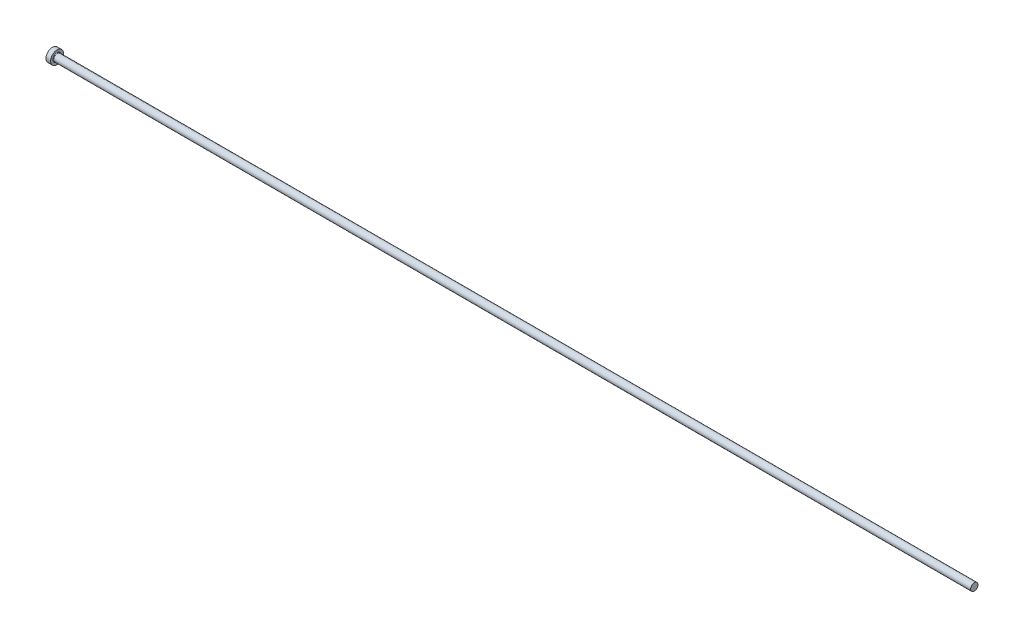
ISO-10303-21;
HEADER;
FILE_DESCRIPTION(('STEP AP214'),'2;1');
FILE_NAME('part.step','',(''),(''),'','','');
FILE_SCHEMA(('AUTOMOTIVE_DESIGN { 1 0 10303 214 1 1 1 1 }'));
ENDSEC;
DATA;
#1=APPLICATION_CONTEXT('core data for automotive mechanical design processes');
#2=APPLICATION_PROTOCOL_DEFINITION('international standard','automotive_design',2000,#1);
#3=PRODUCT_CONTEXT('',#1,'mechanical');
#4=PRODUCT('Part','Part','',(#3));
#5=PRODUCT_RELATED_PRODUCT_CATEGORY('part','',(#4));
#6=PRODUCT_DEFINITION_FORMATION('','',#4);
#7=PRODUCT_DEFINITION_CONTEXT('part definition',#1,'design');
#8=PRODUCT_DEFINITION('design','',#6,#7);
#9=PRODUCT_DEFINITION_SHAPE('','',#8);
#10=(LENGTH_UNIT() NAMED_UNIT(*) SI_UNIT(.MILLI.,.METRE.));
#11=(NAMED_UNIT(*) PLANE_ANGLE_UNIT() SI_UNIT($,.RADIAN.));
#12=(NAMED_UNIT(*) SI_UNIT($,.STERADIAN.) SOLID_ANGLE_UNIT());
#13=UNCERTAINTY_MEASURE_WITH_UNIT(LENGTH_MEASURE(1.E-05),#10,'distance_accuracy_value','');
#14=(GEOMETRIC_REPRESENTATION_CONTEXT(3) GLOBAL_UNCERTAINTY_ASSIGNED_CONTEXT((#13)) GLOBAL_UNIT_ASSIGNED_CONTEXT((#10,
#11,#12)) REPRESENTATION_CONTEXT('',''));
#15=CARTESIAN_POINT('',(0.,0.,0.));
#16=DIRECTION('',(0.,0.,1.));
#17=DIRECTION('',(1.,0.,0.));
#18=AXIS2_PLACEMENT_3D('',#15,#16,#17);
#19=CARTESIAN_POINT('',(0.,0.,0.));
#20=DIRECTION('',(-1.,0.,0.));
#21=DIRECTION('',(0.,-1.,0.));
#22=AXIS2_PLACEMENT_3D('',#19,#20,#21);
#23=PLANE('',#22);
#24=CARTESIAN_POINT('',(0.,0.,0.));
#25=DIRECTION('',(1.,0.,0.));
#26=DIRECTION('',(0.,1.,0.));
#27=AXIS2_PLACEMENT_3D('',#24,#25,#26);
#28=CIRCLE('',#27,7.);
#29=CARTESIAN_POINT('',(0.,7.,0.));
#30=VERTEX_POINT('',#29);
#31=EDGE_CURVE('E25',#30,#30,#28,.T.);
#32=ORIENTED_EDGE('',*,*,#31,.F.);
#33=EDGE_LOOP('',(#32));
#34=FACE_BOUND('',#33,.T.);
#35=ADVANCED_FACE('F14',(#34),#23,.T.);
#36=CARTESIAN_POINT('',(1000.,1.10218211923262E-13,0.));
#37=DIRECTION('',(1.,0.,0.));
#38=DIRECTION('',(0.,1.,0.));
#39=AXIS2_PLACEMENT_3D('',#36,#37,#38);
#40=CYLINDRICAL_SURFACE('',#39,7.);
#41=ORIENTED_EDGE('',*,*,#31,.T.);
#42=EDGE_LOOP('',(#41));
#43=FACE_BOUND('',#42,.T.);
#44=CARTESIAN_POINT('',(5.,0.,0.));
#45=DIRECTION('',(1.,0.,0.));
#46=DIRECTION('',(0.,1.,0.));
#47=AXIS2_PLACEMENT_3D('',#44,#45,#46);
#48=CIRCLE('',#47,7.);
#49=CARTESIAN_POINT('',(5.,7.,0.));
#50=VERTEX_POINT('',#49);
#51=EDGE_CURVE('E29',#50,#50,#48,.T.);
#52=ORIENTED_EDGE('',*,*,#51,.F.);
#53=EDGE_LOOP('',(#52));
#54=FACE_BOUND('',#53,.T.);
#55=ADVANCED_FACE('F51',(#43,#54),#40,.T.);
#56=CARTESIAN_POINT('',(5.,7.,0.));
#57=DIRECTION('',(1.,0.,0.));
#58=DIRECTION('',(0.,1.,0.));
#59=AXIS2_PLACEMENT_3D('',#56,#57,#58);
#60=PLANE('',#59);
#61=CARTESIAN_POINT('',(5.,0.,0.));
#62=DIRECTION('',(1.,0.,0.));
#63=DIRECTION('',(0.,1.,0.));
#64=AXIS2_PLACEMENT_3D('',#61,#62,#63);
#65=CIRCLE('',#64,4.4999999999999);
#66=CARTESIAN_POINT('',(5.,4.4999999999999,0.));
#67=VERTEX_POINT('',#66);
#68=EDGE_CURVE('E9',#67,#67,#65,.F.);
#69=ORIENTED_EDGE('',*,*,#68,.T.);
#70=EDGE_LOOP('',(#69));
#71=FACE_BOUND('',#70,.T.);
#72=ORIENTED_EDGE('',*,*,#51,.T.);
#73=EDGE_LOOP('',(#72));
#74=FACE_BOUND('',#73,.T.);
#75=ADVANCED_FACE('F42',(#71,#74),#60,.T.);
#76=CARTESIAN_POINT('',(1000.,1.10218211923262E-13,0.));
#77=DIRECTION('',(1.,0.,0.));
#78=DIRECTION('',(0.,1.,0.));
#79=AXIS2_PLACEMENT_3D('',#76,#77,#78);
#80=CYLINDRICAL_SURFACE('',#79,3.9999999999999);
#81=CARTESIAN_POINT('',(5.5,0.,0.));
#82=DIRECTION('',(1.,0.,0.));
#83=DIRECTION('',(0.,1.,0.));
#84=AXIS2_PLACEMENT_3D('',#81,#82,#83);
#85=CIRCLE('',#84,3.9999999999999);
#86=CARTESIAN_POINT('',(5.5,3.9999999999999,0.));
#87=VERTEX_POINT('',#86);
#88=EDGE_CURVE('E21',#87,#87,#85,.T.);
#89=ORIENTED_EDGE('',*,*,#88,.T.);
#90=EDGE_LOOP('',(#89));
#91=FACE_BOUND('',#90,.T.);
#92=CARTESIAN_POINT('',(1000.,1.10218211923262E-13,0.));
#93=DIRECTION('',(1.,0.,0.));
#94=DIRECTION('',(0.,1.,0.));
#95=AXIS2_PLACEMENT_3D('',#92,#93,#94);
#96=CIRCLE('',#95,3.99999999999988);
#97=CARTESIAN_POINT('',(1000.,3.99999999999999,0.));
#98=VERTEX_POINT('',#97);
#99=EDGE_CURVE('E34',#98,#98,#96,.T.);
#100=ORIENTED_EDGE('',*,*,#99,.F.);
#101=EDGE_LOOP('',(#100));
#102=FACE_BOUND('',#101,.T.);
#103=ADVANCED_FACE('F40',(#91,#102),#80,.T.);
#104=CARTESIAN_POINT('',(1000.,4.,0.));
#105=DIRECTION('',(1.,0.,0.));
#106=DIRECTION('',(0.,1.,0.));
#107=AXIS2_PLACEMENT_3D('',#104,#105,#106);
#108=PLANE('',#107);
#109=ORIENTED_EDGE('',*,*,#99,.T.);
#110=EDGE_LOOP('',(#109));
#111=FACE_BOUND('',#110,.T.);
#112=ADVANCED_FACE('F38',(#111),#108,.T.);
#113=CARTESIAN_POINT('',(5.5,0.,0.));
#114=DIRECTION('',(1.,0.,0.));
#115=DIRECTION('',(0.,1.,0.));
#116=AXIS2_PLACEMENT_3D('',#113,#114,#115);
#117=TOROIDAL_SURFACE('',#116,4.4999999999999,0.5);
#118=ORIENTED_EDGE('',*,*,#68,.F.);
#119=EDGE_LOOP('',(#118));
#120=FACE_BOUND('',#119,.T.);
#121=ORIENTED_EDGE('',*,*,#88,.F.);
#122=EDGE_LOOP('',(#121));
#123=FACE_BOUND('',#122,.T.);
#124=ADVANCED_FACE('F16',(#120,#123),#117,.F.);
#125=CLOSED_SHELL('',(#35,#55,#75,#103,#112,#124));
#126=MANIFOLD_SOLID_BREP('B1',#125);
#127=ADVANCED_BREP_SHAPE_REPRESENTATION('',(#18,#126),#14);
#128=SHAPE_DEFINITION_REPRESENTATION(#9,#127);
ENDSEC;
END-ISO-10303-21;
